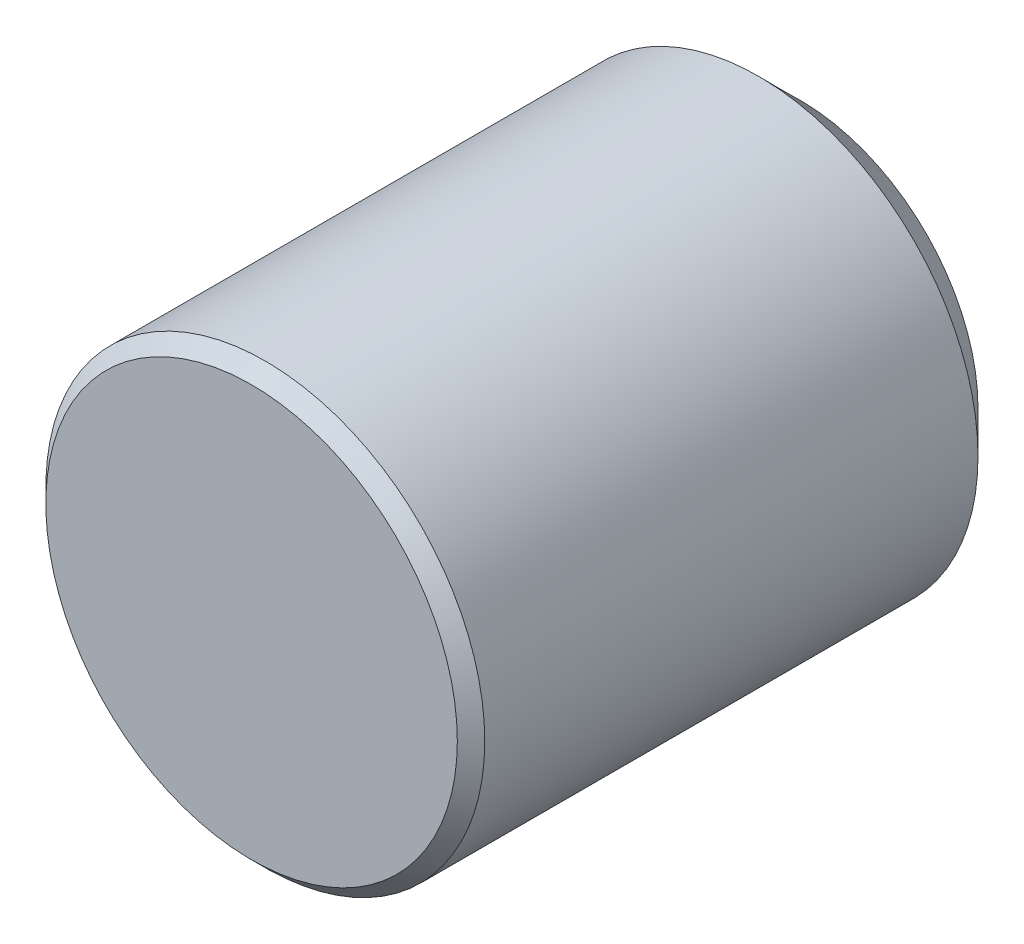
ISO-10303-21;
HEADER;
FILE_DESCRIPTION(('STEP AP214'),'2;1');
FILE_NAME('part.step','',(''),(''),'','','');
FILE_SCHEMA(('AUTOMOTIVE_DESIGN { 1 0 10303 214 1 1 1 1 }'));
ENDSEC;
DATA;
#1=APPLICATION_CONTEXT('core data for automotive mechanical design processes');
#2=APPLICATION_PROTOCOL_DEFINITION('international standard','automotive_design',2000,#1);
#3=PRODUCT_CONTEXT('',#1,'mechanical');
#4=PRODUCT('Part','Part','',(#3));
#5=PRODUCT_RELATED_PRODUCT_CATEGORY('part','',(#4));
#6=PRODUCT_DEFINITION_FORMATION('','',#4);
#7=PRODUCT_DEFINITION_CONTEXT('part definition',#1,'design');
#8=PRODUCT_DEFINITION('design','',#6,#7);
#9=PRODUCT_DEFINITION_SHAPE('','',#8);
#10=(LENGTH_UNIT() NAMED_UNIT(*) SI_UNIT(.MILLI.,.METRE.));
#11=(NAMED_UNIT(*) PLANE_ANGLE_UNIT() SI_UNIT($,.RADIAN.));
#12=(NAMED_UNIT(*) SI_UNIT($,.STERADIAN.) SOLID_ANGLE_UNIT());
#13=UNCERTAINTY_MEASURE_WITH_UNIT(LENGTH_MEASURE(1.E-05),#10,'distance_accuracy_value','');
#14=(GEOMETRIC_REPRESENTATION_CONTEXT(3) GLOBAL_UNCERTAINTY_ASSIGNED_CONTEXT((#13)) GLOBAL_UNIT_ASSIGNED_CONTEXT((#10,
#11,#12)) REPRESENTATION_CONTEXT('',''));
#15=CARTESIAN_POINT('',(0.,0.,0.));
#16=DIRECTION('',(0.,0.,1.));
#17=DIRECTION('',(1.,0.,0.));
#18=AXIS2_PLACEMENT_3D('',#15,#16,#17);
#19=CARTESIAN_POINT('',(0.,0.,0.));
#20=DIRECTION('',(0.,0.,1.));
#21=DIRECTION('',(1.,0.,0.));
#22=AXIS2_PLACEMENT_3D('',#19,#20,#21);
#23=PLANE('',#22);
#24=CARTESIAN_POINT('',(0.,0.,0.));
#25=DIRECTION('',(0.,0.,-1.));
#26=DIRECTION('',(-1.,0.,0.));
#27=AXIS2_PLACEMENT_3D('',#24,#25,#26);
#28=CIRCLE('',#27,2.);
#29=CARTESIAN_POINT('',(-2.,0.,0.));
#30=VERTEX_POINT('',#29);
#31=EDGE_CURVE('E33',#30,#30,#28,.T.);
#32=ORIENTED_EDGE('',*,*,#31,.F.);
#33=EDGE_LOOP('',(#32));
#34=FACE_BOUND('',#33,.T.);
#35=CARTESIAN_POINT('',(0.,0.,0.));
#36=DIRECTION('',(0.,0.,1.));
#37=DIRECTION('',(1.,0.,0.));
#38=AXIS2_PLACEMENT_3D('',#35,#36,#37);
#39=CIRCLE('',#38,3.24);
#40=CARTESIAN_POINT('',(3.24,0.,0.));
#41=VERTEX_POINT('',#40);
#42=EDGE_CURVE('E23',#41,#41,#39,.F.);
#43=ORIENTED_EDGE('',*,*,#42,.T.);
#44=EDGE_LOOP('',(#43));
#45=FACE_BOUND('',#44,.T.);
#46=ADVANCED_FACE('F12',(#34,#45),#23,.F.);
#47=CARTESIAN_POINT('',(0.,0.,10.));
#48=DIRECTION('',(0.,0.,-1.));
#49=DIRECTION('',(-1.,0.,0.));
#50=AXIS2_PLACEMENT_3D('',#47,#48,#49);
#51=CYLINDRICAL_SURFACE('',#50,4.);
#52=CARTESIAN_POINT('',(0.,0.,9.75));
#53=DIRECTION('',(0.,0.,1.));
#54=DIRECTION('',(1.,0.,0.));
#55=AXIS2_PLACEMENT_3D('',#52,#53,#54);
#56=CIRCLE('',#55,4.);
#57=CARTESIAN_POINT('',(4.,0.,9.75));
#58=VERTEX_POINT('',#57);
#59=EDGE_CURVE('E8',#58,#58,#56,.F.);
#60=ORIENTED_EDGE('',*,*,#59,.T.);
#61=EDGE_LOOP('',(#60));
#62=FACE_BOUND('',#61,.T.);
#63=CARTESIAN_POINT('',(0.,0.,0.760000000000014));
#64=DIRECTION('',(0.,0.,1.));
#65=DIRECTION('',(1.,0.,0.));
#66=AXIS2_PLACEMENT_3D('',#63,#64,#65);
#67=CIRCLE('',#66,4.);
#68=CARTESIAN_POINT('',(4.,0.,0.760000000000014));
#69=VERTEX_POINT('',#68);
#70=EDGE_CURVE('E27',#69,#69,#67,.T.);
#71=ORIENTED_EDGE('',*,*,#70,.T.);
#72=EDGE_LOOP('',(#71));
#73=FACE_BOUND('',#72,.T.);
#74=ADVANCED_FACE('F49',(#62,#73),#51,.T.);
#75=CARTESIAN_POINT('',(0.,0.,10.));
#76=DIRECTION('',(0.,0.,1.));
#77=DIRECTION('',(1.,0.,0.));
#78=AXIS2_PLACEMENT_3D('',#75,#76,#77);
#79=PLANE('',#78);
#80=CARTESIAN_POINT('',(0.,0.,10.));
#81=DIRECTION('',(0.,0.,1.));
#82=DIRECTION('',(1.,0.,0.));
#83=AXIS2_PLACEMENT_3D('',#80,#81,#82);
#84=CIRCLE('',#83,3.75);
#85=CARTESIAN_POINT('',(3.75,0.,10.));
#86=VERTEX_POINT('',#85);
#87=EDGE_CURVE('E19',#86,#86,#84,.T.);
#88=ORIENTED_EDGE('',*,*,#87,.T.);
#89=EDGE_LOOP('',(#88));
#90=FACE_BOUND('',#89,.T.);
#91=ADVANCED_FACE('F56',(#90),#79,.T.);
#92=CARTESIAN_POINT('',(0.,0.,0.760000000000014));
#93=DIRECTION('',(0.,0.,1.));
#94=DIRECTION('',(1.,0.,0.));
#95=AXIS2_PLACEMENT_3D('',#92,#93,#94);
#96=CONICAL_SURFACE('',#95,4.,0.785398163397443);
#97=ORIENTED_EDGE('',*,*,#42,.F.);
#98=EDGE_LOOP('',(#97));
#99=FACE_BOUND('',#98,.T.);
#100=ORIENTED_EDGE('',*,*,#70,.F.);
#101=EDGE_LOOP('',(#100));
#102=FACE_BOUND('',#101,.T.);
#103=ADVANCED_FACE('F53',(#99,#102),#96,.T.);
#104=CARTESIAN_POINT('',(0.,0.,10.));
#105=DIRECTION('',(0.,0.,-1.));
#106=DIRECTION('',(-1.,0.,0.));
#107=AXIS2_PLACEMENT_3D('',#104,#105,#106);
#108=CONICAL_SURFACE('',#107,3.75,0.785398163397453);
#109=ORIENTED_EDGE('',*,*,#59,.F.);
#110=EDGE_LOOP('',(#109));
#111=FACE_BOUND('',#110,.T.);
#112=ORIENTED_EDGE('',*,*,#87,.F.);
#113=EDGE_LOOP('',(#112));
#114=FACE_BOUND('',#113,.T.);
#115=ADVANCED_FACE('F14',(#111,#114),#108,.T.);
#116=CARTESIAN_POINT('',(0.,0.,5.));
#117=DIRECTION('',(0.,0.,-1.));
#118=DIRECTION('',(-1.,0.,0.));
#119=AXIS2_PLACEMENT_3D('',#116,#117,#118);
#120=CYLINDRICAL_SURFACE('',#119,2.);
#121=CARTESIAN_POINT('',(0.,0.,5.));
#122=DIRECTION('',(0.,0.,-1.));
#123=DIRECTION('',(-1.,0.,0.));
#124=AXIS2_PLACEMENT_3D('',#121,#122,#123);
#125=CIRCLE('',#124,2.);
#126=CARTESIAN_POINT('',(-2.,0.,5.));
#127=VERTEX_POINT('',#126);
#128=EDGE_CURVE('E32',#127,#127,#125,.T.);
#129=ORIENTED_EDGE('',*,*,#128,.F.);
#130=EDGE_LOOP('',(#129));
#131=FACE_BOUND('',#130,.T.);
#132=ORIENTED_EDGE('',*,*,#31,.T.);
#133=EDGE_LOOP('',(#132));
#134=FACE_BOUND('',#133,.T.);
#135=ADVANCED_FACE('F41',(#131,#134),#120,.F.);
#136=CARTESIAN_POINT('',(0.,0.,5.));
#137=DIRECTION('',(0.,0.,-1.));
#138=DIRECTION('',(-1.,0.,0.));
#139=AXIS2_PLACEMENT_3D('',#136,#137,#138);
#140=PLANE('',#139);
#141=ORIENTED_EDGE('',*,*,#128,.T.);
#142=EDGE_LOOP('',(#141));
#143=FACE_BOUND('',#142,.T.);
#144=ADVANCED_FACE('F39',(#143),#140,.T.);
#145=CLOSED_SHELL('',(#46,#74,#91,#103,#115,#135,#144));
#146=MANIFOLD_SOLID_BREP('B1',#145);
#147=ADVANCED_BREP_SHAPE_REPRESENTATION('',(#18,#146),#14);
#148=SHAPE_DEFINITION_REPRESENTATION(#9,#147);
ENDSEC;
END-ISO-10303-21;
